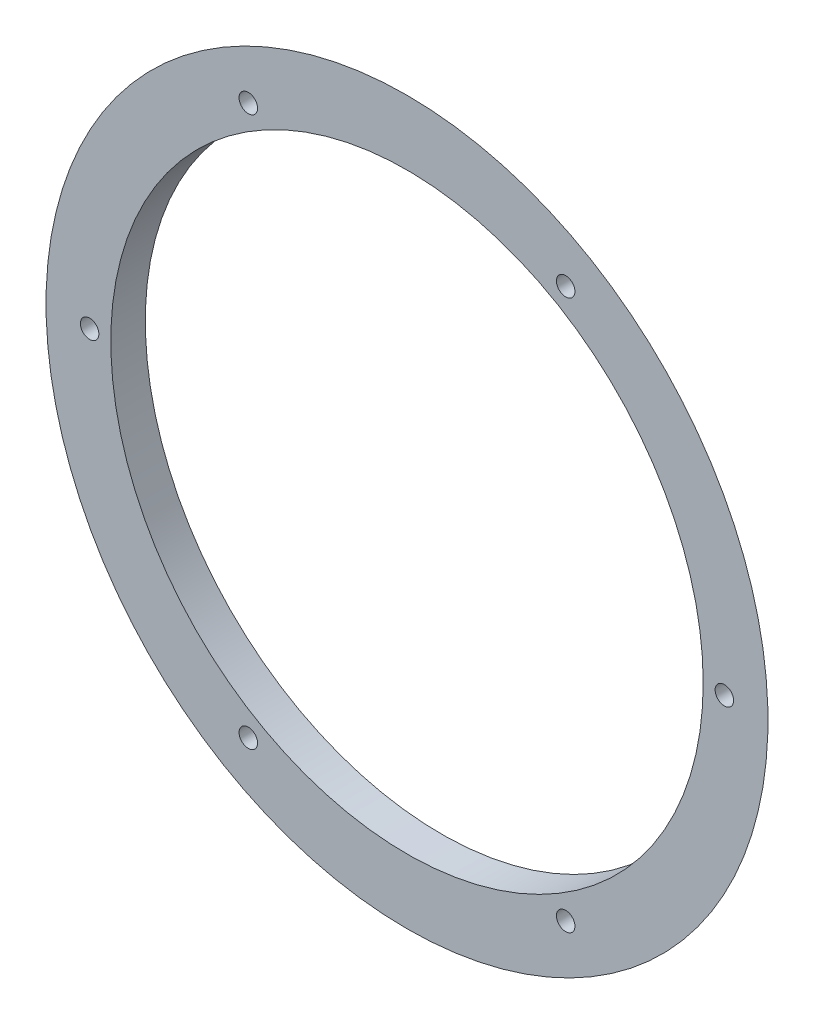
ISO-10303-21;
HEADER;
FILE_DESCRIPTION(('STEP AP214'),'2;1');
FILE_NAME('part.step','',(''),(''),'','','');
FILE_SCHEMA(('AUTOMOTIVE_DESIGN { 1 0 10303 214 1 1 1 1 }'));
ENDSEC;
DATA;
#1=APPLICATION_CONTEXT('core data for automotive mechanical design processes');
#2=APPLICATION_PROTOCOL_DEFINITION('international standard','automotive_design',2000,#1);
#3=PRODUCT_CONTEXT('',#1,'mechanical');
#4=PRODUCT('Part','Part','',(#3));
#5=PRODUCT_RELATED_PRODUCT_CATEGORY('part','',(#4));
#6=PRODUCT_DEFINITION_FORMATION('','',#4);
#7=PRODUCT_DEFINITION_CONTEXT('part definition',#1,'design');
#8=PRODUCT_DEFINITION('design','',#6,#7);
#9=PRODUCT_DEFINITION_SHAPE('','',#8);
#10=(LENGTH_UNIT() NAMED_UNIT(*) SI_UNIT(.MILLI.,.METRE.));
#11=(NAMED_UNIT(*) PLANE_ANGLE_UNIT() SI_UNIT($,.RADIAN.));
#12=(NAMED_UNIT(*) SI_UNIT($,.STERADIAN.) SOLID_ANGLE_UNIT());
#13=UNCERTAINTY_MEASURE_WITH_UNIT(LENGTH_MEASURE(1.E-05),#10,'distance_accuracy_value','');
#14=(GEOMETRIC_REPRESENTATION_CONTEXT(3) GLOBAL_UNCERTAINTY_ASSIGNED_CONTEXT((#13)) GLOBAL_UNIT_ASSIGNED_CONTEXT((#10,
#11,#12)) REPRESENTATION_CONTEXT('',''));
#15=CARTESIAN_POINT('',(0.,0.,0.));
#16=DIRECTION('',(0.,0.,1.));
#17=DIRECTION('',(1.,0.,0.));
#18=AXIS2_PLACEMENT_3D('',#15,#16,#17);
#19=CARTESIAN_POINT('',(0.,0.,-9.525));
#20=DIRECTION('',(0.,0.,1.));
#21=DIRECTION('',(1.,0.,0.));
#22=AXIS2_PLACEMENT_3D('',#19,#20,#21);
#23=PLANE('',#22);
#24=CARTESIAN_POINT('',(0.,0.,-9.525));
#25=DIRECTION('',(0.,0.,1.));
#26=DIRECTION('',(1.,0.,0.));
#27=AXIS2_PLACEMENT_3D('',#24,#25,#26);
#28=CIRCLE('',#27,81.788);
#29=CARTESIAN_POINT('',(81.788,0.,-9.525));
#30=VERTEX_POINT('',#29);
#31=EDGE_CURVE('E10',#30,#30,#28,.T.);
#32=ORIENTED_EDGE('',*,*,#31,.T.);
#33=EDGE_LOOP('',(#32));
#34=FACE_BOUND('',#33,.T.);
#35=CARTESIAN_POINT('',(0.,0.,-9.52500000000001));
#36=DIRECTION('',(0.,0.,-1.));
#37=DIRECTION('',(0.,1.,0.));
#38=AXIS2_PLACEMENT_3D('',#35,#36,#37);
#39=CIRCLE('',#38,83.068649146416);
#40=CARTESIAN_POINT('',(0.,83.068649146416,-9.52500000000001));
#41=VERTEX_POINT('',#40);
#42=EDGE_CURVE('E179',#41,#41,#39,.T.);
#43=ORIENTED_EDGE('',*,*,#42,.T.);
#44=EDGE_LOOP('',(#43));
#45=FACE_BOUND('',#44,.T.);
#46=ADVANCED_FACE('F49',(#34,#45),#23,.F.);
#47=CARTESIAN_POINT('',(0.,0.,0.));
#48=DIRECTION('',(0.,0.,1.));
#49=DIRECTION('',(1.,0.,0.));
#50=AXIS2_PLACEMENT_3D('',#47,#48,#49);
#51=PLANE('',#50);
#52=CARTESIAN_POINT('',(-87.63,0.,0.));
#53=DIRECTION('',(0.,0.,1.));
#54=DIRECTION('',(1.,0.,0.));
#55=AXIS2_PLACEMENT_3D('',#52,#53,#54);
#56=CIRCLE('',#55,2.55270000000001);
#57=CARTESIAN_POINT('',(-85.0773,0.,0.));
#58=VERTEX_POINT('',#57);
#59=EDGE_CURVE('E91',#58,#58,#56,.T.);
#60=ORIENTED_EDGE('',*,*,#59,.F.);
#61=EDGE_LOOP('',(#60));
#62=FACE_BOUND('',#61,.T.);
#63=CARTESIAN_POINT('',(-43.815,75.8898061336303,0.));
#64=DIRECTION('',(0.,0.,1.));
#65=DIRECTION('',(1.,0.,0.));
#66=AXIS2_PLACEMENT_3D('',#63,#64,#65);
#67=CIRCLE('',#66,2.5527);
#68=CARTESIAN_POINT('',(-41.2623,75.8898061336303,0.));
#69=VERTEX_POINT('',#68);
#70=EDGE_CURVE('E87',#69,#69,#67,.T.);
#71=ORIENTED_EDGE('',*,*,#70,.F.);
#72=EDGE_LOOP('',(#71));
#73=FACE_BOUND('',#72,.T.);
#74=CARTESIAN_POINT('',(43.815,75.8898061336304,0.));
#75=DIRECTION('',(0.,0.,1.));
#76=DIRECTION('',(1.,0.,0.));
#77=AXIS2_PLACEMENT_3D('',#74,#75,#76);
#78=CIRCLE('',#77,2.5527);
#79=CARTESIAN_POINT('',(46.3677,75.8898061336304,0.));
#80=VERTEX_POINT('',#79);
#81=EDGE_CURVE('E83',#80,#80,#78,.T.);
#82=ORIENTED_EDGE('',*,*,#81,.F.);
#83=EDGE_LOOP('',(#82));
#84=FACE_BOUND('',#83,.T.);
#85=CARTESIAN_POINT('',(87.63,0.,0.));
#86=DIRECTION('',(0.,0.,1.));
#87=DIRECTION('',(1.,0.,0.));
#88=AXIS2_PLACEMENT_3D('',#85,#86,#87);
#89=CIRCLE('',#88,2.55270000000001);
#90=CARTESIAN_POINT('',(90.1827,0.,0.));
#91=VERTEX_POINT('',#90);
#92=EDGE_CURVE('E79',#91,#91,#89,.T.);
#93=ORIENTED_EDGE('',*,*,#92,.F.);
#94=EDGE_LOOP('',(#93));
#95=FACE_BOUND('',#94,.T.);
#96=CARTESIAN_POINT('',(43.815,-75.8898061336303,0.));
#97=DIRECTION('',(0.,0.,1.));
#98=DIRECTION('',(1.,0.,0.));
#99=AXIS2_PLACEMENT_3D('',#96,#97,#98);
#100=CIRCLE('',#99,2.5527);
#101=CARTESIAN_POINT('',(46.3677,-75.8898061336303,0.));
#102=VERTEX_POINT('',#101);
#103=EDGE_CURVE('E75',#102,#102,#100,.T.);
#104=ORIENTED_EDGE('',*,*,#103,.F.);
#105=EDGE_LOOP('',(#104));
#106=FACE_BOUND('',#105,.T.);
#107=CARTESIAN_POINT('',(-43.815,-75.8898061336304,0.));
#108=DIRECTION('',(0.,0.,1.));
#109=DIRECTION('',(1.,0.,0.));
#110=AXIS2_PLACEMENT_3D('',#107,#108,#109);
#111=CIRCLE('',#110,2.5527);
#112=CARTESIAN_POINT('',(-41.2623,-75.8898061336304,0.));
#113=VERTEX_POINT('',#112);
#114=EDGE_CURVE('E70',#113,#113,#111,.T.);
#115=ORIENTED_EDGE('',*,*,#114,.F.);
#116=EDGE_LOOP('',(#115));
#117=FACE_BOUND('',#116,.T.);
#118=CARTESIAN_POINT('',(0.,0.,0.));
#119=DIRECTION('',(0.,0.,1.));
#120=DIRECTION('',(1.,0.,0.));
#121=AXIS2_PLACEMENT_3D('',#118,#119,#120);
#122=CIRCLE('',#121,81.788);
#123=CARTESIAN_POINT('',(81.788,0.,0.));
#124=VERTEX_POINT('',#123);
#125=EDGE_CURVE('E63',#124,#124,#122,.T.);
#126=ORIENTED_EDGE('',*,*,#125,.F.);
#127=EDGE_LOOP('',(#126));
#128=FACE_BOUND('',#127,.T.);
#129=CARTESIAN_POINT('',(0.,0.,0.));
#130=DIRECTION('',(0.,0.,-1.));
#131=DIRECTION('',(0.,1.,0.));
#132=AXIS2_PLACEMENT_3D('',#129,#130,#131);
#133=CIRCLE('',#132,99.6696);
#134=CARTESIAN_POINT('',(0.,99.6696,0.));
#135=VERTEX_POINT('',#134);
#136=EDGE_CURVE('E176',#135,#135,#133,.T.);
#137=ORIENTED_EDGE('',*,*,#136,.F.);
#138=EDGE_LOOP('',(#137));
#139=FACE_BOUND('',#138,.T.);
#140=ADVANCED_FACE('F51',(#62,#73,#84,#95,#106,#117,#128,#139),#51,.T.);
#141=CARTESIAN_POINT('',(0.,0.,-9.525));
#142=DIRECTION('',(0.,0.,1.));
#143=DIRECTION('',(1.,0.,0.));
#144=AXIS2_PLACEMENT_3D('',#141,#142,#143);
#145=CYLINDRICAL_SURFACE('',#144,81.788);
#146=ORIENTED_EDGE('',*,*,#31,.F.);
#147=EDGE_LOOP('',(#146));
#148=FACE_BOUND('',#147,.T.);
#149=ORIENTED_EDGE('',*,*,#125,.T.);
#150=EDGE_LOOP('',(#149));
#151=FACE_BOUND('',#150,.T.);
#152=ADVANCED_FACE('F156',(#148,#151),#145,.F.);
#153=CARTESIAN_POINT('',(-43.815,-75.8898061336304,0.));
#154=DIRECTION('',(0.,0.,1.));
#155=DIRECTION('',(1.,0.,0.));
#156=AXIS2_PLACEMENT_3D('',#153,#154,#155);
#157=CYLINDRICAL_SURFACE('',#156,2.5527);
#158=CARTESIAN_POINT('',(-45.6364177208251,-77.6783012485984,-5.77436857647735));
#159=CARTESIAN_POINT('',(-45.7338059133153,-77.5791080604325,-5.79471515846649));
#160=CARTESIAN_POINT('',(-45.8225791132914,-77.4724106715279,-5.82096701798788));
#161=CARTESIAN_POINT('',(-45.9807200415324,-77.2480660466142,-5.88393819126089));
#162=CARTESIAN_POINT('',(-46.0500385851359,-77.1303920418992,-5.92068357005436));
#163=CARTESIAN_POINT('',(-46.167941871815,-76.8887614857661,-6.0027762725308));
#164=CARTESIAN_POINT('',(-46.2166325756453,-76.7648407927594,-6.04807786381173));
#165=CARTESIAN_POINT('',(-46.2937786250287,-76.5136696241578,-6.1457312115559));
#166=CARTESIAN_POINT('',(-46.322240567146,-76.3864202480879,-6.19808066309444));
#167=CARTESIAN_POINT('',(-46.3611133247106,-76.1204109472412,-6.3130775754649));
#168=CARTESIAN_POINT('',(-46.3697465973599,-75.9816089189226,-6.37622429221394));
#169=CARTESIAN_POINT('',(-46.3648359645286,-75.7066466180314,-6.50722957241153));
#170=CARTESIAN_POINT('',(-46.3512799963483,-75.5704878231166,-6.57509067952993));
#171=CARTESIAN_POINT('',(-46.3003010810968,-75.2876632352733,-6.72216128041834));
#172=CARTESIAN_POINT('',(-46.2602306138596,-75.1416745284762,-6.8017604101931));
#173=CARTESIAN_POINT('',(-46.15552089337,-74.8598230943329,-6.9627461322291));
#174=CARTESIAN_POINT('',(-46.0908705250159,-74.7239649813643,-7.04413351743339));
#175=CARTESIAN_POINT('',(-45.932987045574,-74.4557913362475,-7.21287026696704));
#176=CARTESIAN_POINT('',(-45.8379672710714,-74.3245141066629,-7.30020677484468));
#177=CARTESIAN_POINT('',(-45.6237734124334,-74.0812468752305,-7.47223697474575));
#178=CARTESIAN_POINT('',(-45.5045940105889,-73.9692611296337,-7.55693008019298));
#179=CARTESIAN_POINT('',(-45.2450566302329,-73.7689541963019,-7.72083670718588));
#180=CARTESIAN_POINT('',(-45.1047539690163,-73.680572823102,-7.80006377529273));
#181=CARTESIAN_POINT('',(-44.8061237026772,-73.531468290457,-7.95034864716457));
#182=CARTESIAN_POINT('',(-44.6478044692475,-73.4707323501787,-8.0214102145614));
#183=CARTESIAN_POINT('',(-44.3321895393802,-73.3851776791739,-8.14641131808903));
#184=CARTESIAN_POINT('',(-44.1759980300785,-73.3576987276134,-8.20130169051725));
#185=CARTESIAN_POINT('',(-43.8574870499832,-73.3324824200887,-8.29881855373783));
#186=CARTESIAN_POINT('',(-43.6951747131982,-73.3347114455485,-8.34145885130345));
#187=CARTESIAN_POINT('',(-43.3919443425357,-73.368402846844,-8.40733890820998));
#188=CARTESIAN_POINT('',(-43.2509890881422,-73.3960258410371,-8.43238050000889));
#189=CARTESIAN_POINT('',(-42.974251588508,-73.4752506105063,-8.46989814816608));
#190=CARTESIAN_POINT('',(-42.8384653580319,-73.526833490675,-8.48238408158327));
#191=CARTESIAN_POINT('',(-42.5905684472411,-73.646145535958,-8.49347210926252));
#192=CARTESIAN_POINT('',(-42.4774559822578,-73.7116884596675,-8.49336157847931));
#193=CARTESIAN_POINT('',(-42.2629262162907,-73.8589787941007,-8.4824503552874));
#194=CARTESIAN_POINT('',(-42.1615065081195,-73.9407228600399,-8.47165186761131));
#195=CARTESIAN_POINT('',(-41.9754688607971,-74.1154638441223,-8.44029148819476));
#196=CARTESIAN_POINT('',(-41.8904933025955,-74.2081270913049,-8.41998127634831));
#197=CARTESIAN_POINT('',(-41.7359662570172,-74.4033985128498,-8.37056703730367));
#198=CARTESIAN_POINT('',(-41.6664172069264,-74.5060082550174,-8.34146162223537));
#199=CARTESIAN_POINT('',(-41.5404643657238,-74.7238639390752,-8.27380207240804));
#200=CARTESIAN_POINT('',(-41.4849470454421,-74.8394908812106,-8.23483065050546));
#201=CARTESIAN_POINT('',(-41.3923866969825,-75.0753767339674,-8.1497175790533));
#202=CARTESIAN_POINT('',(-41.3553505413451,-75.1956373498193,-8.10357327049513));
#203=CARTESIAN_POINT('',(-41.2966251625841,-75.4505952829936,-8.00036231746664));
#204=CARTESIAN_POINT('',(-41.2769324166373,-75.58549336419,-7.94265885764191));
#205=CARTESIAN_POINT('',(-41.2589907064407,-75.8542807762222,-7.82186891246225));
#206=CARTESIAN_POINT('',(-41.2607517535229,-75.9881696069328,-7.75877992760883));
#207=CARTESIAN_POINT('',(-41.2861068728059,-76.2679187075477,-7.62102261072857));
#208=CARTESIAN_POINT('',(-41.3122729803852,-76.4133086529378,-7.54586955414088));
#209=CARTESIAN_POINT('',(-41.3885520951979,-76.6960944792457,-7.39272133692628));
#210=CARTESIAN_POINT('',(-41.4386762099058,-76.8334866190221,-7.31472487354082));
#211=CARTESIAN_POINT('',(-41.5668933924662,-77.1094400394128,-7.15049031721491));
#212=CARTESIAN_POINT('',(-41.6471319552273,-77.2469503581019,-7.06415305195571));
#213=CARTESIAN_POINT('',(-41.8320957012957,-77.5052362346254,-6.89256136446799));
#214=CARTESIAN_POINT('',(-41.9368291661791,-77.6260061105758,-6.80730731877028));
#215=CARTESIAN_POINT('',(-42.1712815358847,-77.8497419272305,-6.6382586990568));
#216=CARTESIAN_POINT('',(-42.3015443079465,-77.9522056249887,-6.5545495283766));
#217=CARTESIAN_POINT('',(-42.5823604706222,-78.1313664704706,-6.39363442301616));
#218=CARTESIAN_POINT('',(-42.7329100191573,-78.208068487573,-6.31642726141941));
#219=CARTESIAN_POINT('',(-43.0402591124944,-78.3273197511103,-6.1763361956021));
#220=CARTESIAN_POINT('',(-43.1960601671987,-78.3717231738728,-6.11285505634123));
#221=CARTESIAN_POINT('',(-43.517323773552,-78.4303311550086,-5.99746879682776));
#222=CARTESIAN_POINT('',(-43.6827753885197,-78.4445692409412,-5.94555088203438));
#223=CARTESIAN_POINT('',(-43.9961495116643,-78.4402533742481,-5.86198309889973));
#224=CARTESIAN_POINT('',(-44.1436458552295,-78.4256149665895,-5.82860130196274));
#225=CARTESIAN_POINT('',(-44.3628259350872,-78.3841441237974,-5.788321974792));
#226=CARTESIAN_POINT('',(-44.4355651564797,-78.3670595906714,-5.77652552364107));
#227=CARTESIAN_POINT('',(-44.5796957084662,-78.3264270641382,-5.75636018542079));
#228=CARTESIAN_POINT('',(-44.6510872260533,-78.3028799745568,-5.74799081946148));
#229=CARTESIAN_POINT('',(-44.8452725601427,-78.2291047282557,-5.72983235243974));
#230=CARTESIAN_POINT('',(-44.9659620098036,-78.1721893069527,-5.72378540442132));
#231=CARTESIAN_POINT('',(-45.1967701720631,-78.0402975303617,-5.72313862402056));
#232=CARTESIAN_POINT('',(-45.3069100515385,-77.9653584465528,-5.72851534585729));
#233=CARTESIAN_POINT('',(-45.4499752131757,-77.8508655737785,-5.74362204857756));
#234=CARTESIAN_POINT('',(-45.4887994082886,-77.817825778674,-5.74865428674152));
#235=CARTESIAN_POINT('',(-45.5642696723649,-77.7496232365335,-5.76031914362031));
#236=CARTESIAN_POINT('',(-45.6009161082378,-77.7144608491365,-5.76695149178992));
#237=CARTESIAN_POINT('',(-45.6364177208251,-77.6783012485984,-5.77436857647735));
#238=B_SPLINE_CURVE_WITH_KNOTS('',3,(#158,#159,#160,#161,#162,#163,#164,#165,#166,#167,#168,
#169,#170,#171,#172,#173,#174,#175,#176,#177,#178,#179,#180,#181,#182,#183,#184,#185,#186,#187,
#188,#189,#190,#191,#192,#193,#194,#195,#196,#197,#198,#199,#200,#201,#202,#203,#204,#205,#206,
#207,#208,#209,#210,#211,#212,#213,#214,#215,#216,#217,#218,#219,#220,#221,#222,#223,#224,#225,
#226,#227,#228,#229,#230,#231,#232,#233,#234,#235,#236,#237),.UNSPECIFIED.,.T.,.F.,(4,2,2,2,2,2,
2,2,2,2,2,2,2,2,2,2,2,2,2,2,2,2,2,2,2,2,2,2,2,2,2,2,2,2,2,2,2,2,2,4),(0.,0.421261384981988,
0.843578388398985,1.26369893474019,1.68368241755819,2.14005224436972,2.59667024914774,
3.10761065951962,3.61878239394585,4.16847130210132,4.71828133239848,5.26667579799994,
5.81481647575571,6.31537408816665,6.81536530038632,7.25033458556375,7.68496142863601,
8.07521312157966,8.46538432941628,8.8457692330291,9.22621419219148,9.62671896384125,
10.0273725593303,10.4696908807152,10.9122156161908,11.4073768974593,11.9027679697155,
12.4436452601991,12.9847056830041,13.5388748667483,14.0929392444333,14.6119394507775,
15.1303625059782,15.5832904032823,15.8099014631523,16.0364808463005,16.4349998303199,
16.8327016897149,16.9862930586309,17.1398584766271),.UNSPECIFIED.);
#239=CARTESIAN_POINT('',(-45.6364177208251,-77.6783012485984,-5.77436857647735));
#240=VERTEX_POINT('',#239);
#241=EDGE_CURVE('E95',#240,#240,#238,.T.);
#242=ORIENTED_EDGE('',*,*,#241,.T.);
#243=EDGE_LOOP('',(#242));
#244=FACE_BOUND('',#243,.T.);
#245=ORIENTED_EDGE('',*,*,#114,.T.);
#246=EDGE_LOOP('',(#245));
#247=FACE_BOUND('',#246,.T.);
#248=ADVANCED_FACE('F109',(#244,#247),#157,.F.);
#249=CARTESIAN_POINT('',(43.815,-75.8898061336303,0.));
#250=DIRECTION('',(0.,0.,1.));
#251=DIRECTION('',(1.,0.,0.));
#252=AXIS2_PLACEMENT_3D('',#249,#250,#251);
#253=CYLINDRICAL_SURFACE('',#252,2.5527);
#254=CARTESIAN_POINT('',(41.6071194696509,-77.1710324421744,-7.11063967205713));
#255=CARTESIAN_POINT('',(41.5272075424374,-77.033315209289,-7.19698372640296));
#256=CARTESIAN_POINT('',(41.4601076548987,-76.8879742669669,-7.28336451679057));
#257=CARTESIAN_POINT('',(41.3538025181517,-76.5858599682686,-7.45379945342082));
#258=CARTESIAN_POINT('',(41.3146429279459,-76.4290683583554,-7.53784957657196));
#259=CARTESIAN_POINT('',(41.2664440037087,-76.1078985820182,-7.70123593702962));
#260=CARTESIAN_POINT('',(41.2574859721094,-75.9435011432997,-7.78055888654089));
#261=CARTESIAN_POINT('',(41.2720122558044,-75.6125247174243,-7.93136218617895));
#262=CARTESIAN_POINT('',(41.2954745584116,-75.4459472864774,-8.00284782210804));
#263=CARTESIAN_POINT('',(41.3732127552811,-75.1292342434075,-8.12975622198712));
#264=CARTESIAN_POINT('',(41.4249899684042,-74.9788167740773,-8.18599005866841));
#265=CARTESIAN_POINT('',(41.5577312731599,-74.6870524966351,-8.28632165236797));
#266=CARTESIAN_POINT('',(41.6386646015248,-74.5456963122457,-8.33043211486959));
#267=CARTESIAN_POINT('',(41.8160081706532,-74.2958568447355,-8.39914535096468));
#268=CARTESIAN_POINT('',(41.9090703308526,-74.1854857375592,-8.42553163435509));
#269=CARTESIAN_POINT('',(42.1139057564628,-73.9810270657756,-8.46568093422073));
#270=CARTESIAN_POINT('',(42.2256635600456,-73.8869261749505,-8.4794543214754));
#271=CARTESIAN_POINT('',(42.4516240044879,-73.7277340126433,-8.49283473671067));
#272=CARTESIAN_POINT('',(42.5643415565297,-73.6606355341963,-8.49377574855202));
#273=CARTESIAN_POINT('',(42.7983669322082,-73.5446463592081,-8.48486979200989));
#274=CARTESIAN_POINT('',(42.9196727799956,-73.4957514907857,-8.47502529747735));
#275=CARTESIAN_POINT('',(43.1635100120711,-73.4184235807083,-8.44547306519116));
#276=CARTESIAN_POINT('',(43.2859032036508,-73.3894369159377,-8.42606044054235));
#277=CARTESIAN_POINT('',(43.5318947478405,-73.3497947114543,-8.37836010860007));
#278=CARTESIAN_POINT('',(43.6554932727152,-73.3391418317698,-8.35007111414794));
#279=CARTESIAN_POINT('',(43.9069427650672,-73.3355138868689,-8.28408907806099));
#280=CARTESIAN_POINT('',(44.0347011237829,-73.3434405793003,-8.24599963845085));
#281=CARTESIAN_POINT('',(44.2852790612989,-73.3776109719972,-8.16257425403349));
#282=CARTESIAN_POINT('',(44.4080968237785,-73.4038613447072,-8.11723567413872));
#283=CARTESIAN_POINT('',(44.6586511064,-73.4766668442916,-8.01570980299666));
#284=CARTESIAN_POINT('',(44.7856048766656,-73.5250248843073,-7.95888712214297));
#285=CARTESIAN_POINT('',(45.0282366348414,-73.6398343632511,-7.83976231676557));
#286=CARTESIAN_POINT('',(45.1439093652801,-73.7062941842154,-7.77745766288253));
#287=CARTESIAN_POINT('',(45.375122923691,-73.8639419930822,-7.64123693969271));
#288=CARTESIAN_POINT('',(45.4890057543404,-73.9571328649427,-7.5668219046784));
#289=CARTESIAN_POINT('',(45.698241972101,-74.1603628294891,-7.41500275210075));
#290=CARTESIAN_POINT('',(45.7935866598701,-74.2704097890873,-7.33759725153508));
#291=CARTESIAN_POINT('',(45.9720181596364,-74.5155315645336,-7.1742499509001));
#292=CARTESIAN_POINT('',(46.053107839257,-74.6519869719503,-7.08819017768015));
#293=CARTESIAN_POINT('',(46.1889066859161,-74.9380063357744,-6.91693055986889));
#294=CARTESIAN_POINT('',(46.2436067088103,-75.0875748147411,-6.83173102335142));
#295=CARTESIAN_POINT('',(46.3256930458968,-75.4003537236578,-6.6622021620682));
#296=CARTESIAN_POINT('',(46.352267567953,-75.5638295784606,-6.57796476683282));
#297=CARTESIAN_POINT('',(46.3731050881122,-75.8959598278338,-6.41571910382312));
#298=CARTESIAN_POINT('',(46.3673729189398,-76.0646134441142,-6.33770990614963));
#299=CARTESIAN_POINT('',(46.3230192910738,-76.3914904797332,-6.19547897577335));
#300=CARTESIAN_POINT('',(46.2863684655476,-76.5497393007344,-6.13071394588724));
#301=CARTESIAN_POINT('',(46.1817682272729,-76.8600700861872,-6.01257430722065));
#302=CARTESIAN_POINT('',(46.1138510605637,-77.0121582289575,-5.95918804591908));
#303=CARTESIAN_POINT('',(45.9575994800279,-77.2852023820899,-5.87268291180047));
#304=CARTESIAN_POINT('',(45.8728615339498,-77.4076766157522,-5.83786791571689));
#305=CARTESIAN_POINT('',(45.6814871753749,-77.6376050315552,-5.78132045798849));
#306=CARTESIAN_POINT('',(45.5748733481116,-77.745074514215,-5.7595745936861));
#307=CARTESIAN_POINT('',(45.3573418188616,-77.928227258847,-5.73231169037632));
#308=CARTESIAN_POINT('',(45.2485416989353,-78.0061898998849,-5.72513635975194));
#309=CARTESIAN_POINT('',(45.0199792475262,-78.1441564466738,-5.72229136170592));
#310=CARTESIAN_POINT('',(44.9002210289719,-78.2041670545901,-5.72661739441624));
#311=CARTESIAN_POINT('',(44.6602772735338,-78.3017899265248,-5.74599422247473));
#312=CARTESIAN_POINT('',(44.5404594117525,-78.3404311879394,-5.76045714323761));
#313=CARTESIAN_POINT('',(44.297905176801,-78.3995201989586,-5.79878955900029));
#314=CARTESIAN_POINT('',(44.1751685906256,-78.4199666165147,-5.82265974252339));
#315=CARTESIAN_POINT('',(43.926081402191,-78.4432514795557,-5.8797073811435));
#316=CARTESIAN_POINT('',(43.7997400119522,-78.445509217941,-5.91315670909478));
#317=CARTESIAN_POINT('',(43.550386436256,-78.4318260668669,-5.987728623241));
#318=CARTESIAN_POINT('',(43.427375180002,-78.4158801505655,-6.02885332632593));
#319=CARTESIAN_POINT('',(43.1757792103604,-78.3648151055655,-6.1216493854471));
#320=CARTESIAN_POINT('',(43.0477676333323,-78.3280253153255,-6.17395035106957));
#321=CARTESIAN_POINT('',(42.8011720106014,-78.2362429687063,-6.28452017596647));
#322=CARTESIAN_POINT('',(42.6825949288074,-78.181237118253,-6.34279337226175));
#323=CARTESIAN_POINT('',(42.4430987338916,-78.0473982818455,-6.47114806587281));
#324=CARTESIAN_POINT('',(42.3236545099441,-77.9664787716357,-6.54180322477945));
#325=CARTESIAN_POINT('',(42.1013755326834,-77.7872090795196,-6.68670868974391));
#326=CARTESIAN_POINT('',(41.9985280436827,-77.6888723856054,-6.76095618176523));
#327=CARTESIAN_POINT('',(41.8483637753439,-77.5194915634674,-6.88142378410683));
#328=CARTESIAN_POINT('',(41.7952123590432,-77.4531136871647,-6.92706707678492));
#329=CARTESIAN_POINT('',(41.6958690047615,-77.3155555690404,-7.01868332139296));
#330=CARTESIAN_POINT('',(41.6496773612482,-77.2443751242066,-7.06465628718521));
#331=CARTESIAN_POINT('',(41.6071194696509,-77.1710324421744,-7.11063967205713));
#332=B_SPLINE_CURVE_WITH_KNOTS('',3,(#254,#255,#256,#257,#258,#259,#260,#261,#262,#263,#264,
#265,#266,#267,#268,#269,#270,#271,#272,#273,#274,#275,#276,#277,#278,#279,#280,#281,#282,#283,
#284,#285,#286,#287,#288,#289,#290,#291,#292,#293,#294,#295,#296,#297,#298,#299,#300,#301,#302,
#303,#304,#305,#306,#307,#308,#309,#310,#311,#312,#313,#314,#315,#316,#317,#318,#319,#320,#321,
#322,#323,#324,#325,#326,#327,#328,#329,#330,#331),.UNSPECIFIED.,.T.,.F.,(4,2,2,2,2,2,2,2,2,2,2,
2,2,2,2,2,2,2,2,2,2,2,2,2,2,2,2,2,2,2,2,2,2,2,2,2,2,2,4),(0.,0.543043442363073,1.08697228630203,
1.63236421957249,2.17738602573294,2.68064817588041,3.18338087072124,3.62119542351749,
4.05864966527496,4.45023453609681,4.8417296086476,5.22184131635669,5.60200816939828,
6.00100553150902,6.40014826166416,6.84013544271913,7.28032670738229,7.77296846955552,
8.26584085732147,8.80508286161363,9.34451158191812,9.89911751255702,10.453640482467,
10.9752779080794,11.4963785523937,11.9525772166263,12.4083072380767,12.8083530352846,
13.2082492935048,13.5866897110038,13.9651578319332,14.3556631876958,14.7462764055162,
15.1738314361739,15.6016991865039,16.0816978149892,16.5613263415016,16.8505172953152,
17.1397204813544),.UNSPECIFIED.);
#333=CARTESIAN_POINT('',(41.6071194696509,-77.1710324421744,-7.11063967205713));
#334=VERTEX_POINT('',#333);
#335=EDGE_CURVE('E103',#334,#334,#332,.T.);
#336=ORIENTED_EDGE('',*,*,#335,.T.);
#337=EDGE_LOOP('',(#336));
#338=FACE_BOUND('',#337,.T.);
#339=ORIENTED_EDGE('',*,*,#103,.T.);
#340=EDGE_LOOP('',(#339));
#341=FACE_BOUND('',#340,.T.);
#342=ADVANCED_FACE('F147',(#338,#341),#253,.F.);
#343=CARTESIAN_POINT('',(87.63,0.,0.));
#344=DIRECTION('',(0.,0.,1.));
#345=DIRECTION('',(1.,0.,0.));
#346=AXIS2_PLACEMENT_3D('',#343,#344,#345);
#347=CYLINDRICAL_SURFACE('',#346,2.55270000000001);
#348=CARTESIAN_POINT('',(85.7704955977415,-1.7488633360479,-8.11893176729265));
#349=CARTESIAN_POINT('',(85.6806787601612,-1.65336273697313,-8.16733614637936));
#350=CARTESIAN_POINT('',(85.5973190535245,-1.54996242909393,-8.21223927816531));
#351=CARTESIAN_POINT('',(85.4464797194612,-1.32905760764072,-8.29346350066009));
#352=CARTESIAN_POINT('',(85.3790013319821,-1.21155199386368,-8.32978392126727));
#353=CARTESIAN_POINT('',(85.2625858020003,-0.964538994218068,-8.39242962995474));
#354=CARTESIAN_POINT('',(85.2137253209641,-0.834984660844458,-8.41871359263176));
#355=CARTESIAN_POINT('',(85.1374235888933,-0.567972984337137,-8.45975358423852));
#356=CARTESIAN_POINT('',(85.1099733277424,-0.430518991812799,-8.47451446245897));
#357=CARTESIAN_POINT('',(85.0790386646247,-0.161318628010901,-8.49114860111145));
#358=CARTESIAN_POINT('',(85.0741068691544,-0.0297853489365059,-8.49380019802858));
#359=CARTESIAN_POINT('',(85.0845082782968,0.232224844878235,-8.48820743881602));
#360=CARTESIAN_POINT('',(85.0998375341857,0.362701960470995,-8.47996520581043));
#361=CARTESIAN_POINT('',(85.149139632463,0.61442511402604,-8.45345180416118));
#362=CARTESIAN_POINT('',(85.1824749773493,0.735833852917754,-8.43552356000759));
#363=CARTESIAN_POINT('',(85.2658784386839,0.970966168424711,-8.39065665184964));
#364=CARTESIAN_POINT('',(85.3159485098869,1.08468884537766,-8.36371693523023));
#365=CARTESIAN_POINT('',(85.4334096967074,1.30680637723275,-8.3004975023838));
#366=CARTESIAN_POINT('',(85.5014679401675,1.41474433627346,-8.26385793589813));
#367=CARTESIAN_POINT('',(85.6512155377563,1.61759142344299,-8.18320736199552));
#368=CARTESIAN_POINT('',(85.7329096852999,1.71249594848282,-8.13919376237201));
#369=CARTESIAN_POINT('',(85.9161186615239,1.89667892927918,-8.04044190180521));
#370=CARTESIAN_POINT('',(86.0187965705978,1.98445996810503,-7.98507243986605));
#371=CARTESIAN_POINT('',(86.2344789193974,2.14164193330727,-7.86869880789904));
#372=CARTESIAN_POINT('',(86.3474880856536,2.21103438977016,-7.80769205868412));
#373=CARTESIAN_POINT('',(86.5949287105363,2.33804906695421,-7.67403283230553));
#374=CARTESIAN_POINT('',(86.7303074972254,2.39327972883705,-7.60085927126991));
#375=CARTESIAN_POINT('',(87.0068326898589,2.4797077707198,-7.45128815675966));
#376=CARTESIAN_POINT('',(87.1479817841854,2.51089381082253,-7.37488909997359));
#377=CARTESIAN_POINT('',(87.4466683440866,2.55098462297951,-7.21310286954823));
#378=CARTESIAN_POINT('',(87.6044608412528,2.55741787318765,-7.12756617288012));
#379=CARTESIAN_POINT('',(87.9188715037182,2.54118637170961,-6.95699361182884));
#380=CARTESIAN_POINT('',(88.0754892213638,2.51851104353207,-6.87195794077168));
#381=CARTESIAN_POINT('',(88.3886263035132,2.44286418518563,-6.70180870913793));
#382=CARTESIAN_POINT('',(88.544956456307,2.38887599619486,-6.61679335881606));
#383=CARTESIAN_POINT('',(88.8467639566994,2.2501839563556,-6.452541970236));
#384=CARTESIAN_POINT('',(88.9922422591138,2.16548281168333,-6.37330542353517));
#385=CARTESIAN_POINT('',(89.2593980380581,1.97157868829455,-6.22769892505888));
#386=CARTESIAN_POINT('',(89.3819250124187,1.86389916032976,-6.1608713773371));
#387=CARTESIAN_POINT('',(89.6065384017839,1.62374614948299,-6.03829982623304));
#388=CARTESIAN_POINT('',(89.7086446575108,1.49129697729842,-5.98254506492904));
#389=CARTESIAN_POINT('',(89.8758412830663,1.22243867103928,-5.89121172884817));
#390=CARTESIAN_POINT('',(89.943921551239,1.08846528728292,-5.85400492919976));
#391=CARTESIAN_POINT('',(90.0280163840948,0.878357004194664,-5.80803526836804));
#392=CARTESIAN_POINT('',(90.0530455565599,0.806787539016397,-5.79435114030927));
#393=CARTESIAN_POINT('',(90.0967580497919,0.661180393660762,-5.77045000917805));
#394=CARTESIAN_POINT('',(90.1154421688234,0.587143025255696,-5.76023256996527));
#395=CARTESIAN_POINT('',(90.1576149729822,0.381154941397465,-5.73716898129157));
#396=CARTESIAN_POINT('',(90.1742528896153,0.247288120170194,-5.72806819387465));
#397=CARTESIAN_POINT('',(90.1861552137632,-0.0215751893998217,-5.72155789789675));
#398=CARTESIAN_POINT('',(90.1814285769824,-0.156571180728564,-5.72414349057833));
#399=CARTESIAN_POINT('',(90.1518429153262,-0.415346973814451,-5.74032535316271));
#400=CARTESIAN_POINT('',(90.1282152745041,-0.539312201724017,-5.75324816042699));
#401=CARTESIAN_POINT('',(90.0634724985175,-0.781128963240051,-5.7886507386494));
#402=CARTESIAN_POINT('',(90.0223566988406,-0.898980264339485,-5.81113087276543));
#403=CARTESIAN_POINT('',(89.923109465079,-1.12870960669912,-5.86537847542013));
#404=CARTESIAN_POINT('',(89.8645687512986,-1.24035699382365,-5.89736930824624));
#405=CARTESIAN_POINT('',(89.7331601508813,-1.45208003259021,-5.96915334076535));
#406=CARTESIAN_POINT('',(89.6602877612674,-1.55215203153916,-6.00894899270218));
#407=CARTESIAN_POINT('',(89.4953892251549,-1.74768633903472,-6.09896079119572));
#408=CARTESIAN_POINT('',(89.4022235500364,-1.84190049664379,-6.14979565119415));
#409=CARTESIAN_POINT('',(89.2046081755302,-2.01346285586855,-6.25756455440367));
#410=CARTESIAN_POINT('',(89.1001533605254,-2.0908033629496,-6.31450136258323));
#411=CARTESIAN_POINT('',(88.8695459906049,-2.23619068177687,-6.44012930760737));
#412=CARTESIAN_POINT('',(88.742296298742,-2.30198876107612,-6.50940969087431));
#413=CARTESIAN_POINT('',(88.4805178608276,-2.41102192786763,-6.65183563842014));
#414=CARTESIAN_POINT('',(88.3459859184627,-2.45424701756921,-6.72498289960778));
#415=CARTESIAN_POINT('',(88.0580079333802,-2.5213548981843,-6.88145076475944));
#416=CARTESIAN_POINT('',(87.9040877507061,-2.54264623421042,-6.96501723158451));
#417=CARTESIAN_POINT('',(87.5951025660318,-2.55714760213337,-7.13263970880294));
#418=CARTESIAN_POINT('',(87.440036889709,-2.55033951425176,-7.21669600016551));
#419=CARTESIAN_POINT('',(87.1246832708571,-2.50750207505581,-7.38750771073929));
#420=CARTESIAN_POINT('',(86.9645492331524,-2.46995563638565,-7.47417278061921));
#421=CARTESIAN_POINT('',(86.6524443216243,-2.36384608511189,-7.64295487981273));
#422=CARTESIAN_POINT('',(86.5004646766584,-2.29531707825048,-7.72507679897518));
#423=CARTESIAN_POINT('',(86.2489803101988,-2.15038001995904,-7.86087125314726));
#424=CARTESIAN_POINT('',(86.1463214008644,-2.08099526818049,-7.91627349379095));
#425=CARTESIAN_POINT('',(85.9505895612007,-1.92649483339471,-8.02185491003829));
#426=CARTESIAN_POINT('',(85.8575121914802,-1.84138648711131,-8.07203650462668));
#427=CARTESIAN_POINT('',(85.7704955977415,-1.7488633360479,-8.11893176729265));
#428=B_SPLINE_CURVE_WITH_KNOTS('',3,(#348,#349,#350,#351,#352,#353,#354,#355,#356,#357,#358,
#359,#360,#361,#362,#363,#364,#365,#366,#367,#368,#369,#370,#371,#372,#373,#374,#375,#376,#377,
#378,#379,#380,#381,#382,#383,#384,#385,#386,#387,#388,#389,#390,#391,#392,#393,#394,#395,#396,
#397,#398,#399,#400,#401,#402,#403,#404,#405,#406,#407,#408,#409,#410,#411,#412,#413,#414,#415,
#416,#417,#418,#419,#420,#421,#422,#423,#424,#425,#426,#427),.UNSPECIFIED.,.T.,.F.,(4,2,2,2,2,2,
2,2,2,2,2,2,2,2,2,2,2,2,2,2,2,2,2,2,2,2,2,2,2,2,2,2,2,2,2,2,2,2,2,4),(0.,0.418843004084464,
0.83771869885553,1.25830099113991,1.6787061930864,2.0716697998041,2.46455683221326,
2.84436736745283,3.22422228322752,3.62084783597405,4.01761310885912,4.45382486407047,
4.89023719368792,5.37870954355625,5.86741212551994,6.4038086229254,6.94040007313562,
7.49547459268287,8.05050021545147,8.57632639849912,9.10163918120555,9.56313565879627,
9.79393645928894,10.0247082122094,10.4280049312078,10.8311326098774,11.2099475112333,
11.5887768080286,11.9773200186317,12.3659855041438,12.7900190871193,13.214245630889,
13.6896800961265,14.1653249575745,14.6923114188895,15.2196377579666,15.7746808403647,
16.3291144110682,16.735087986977,17.1408726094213),.UNSPECIFIED.);
#429=CARTESIAN_POINT('',(85.7704955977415,-1.7488633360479,-8.11893176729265));
#430=VERTEX_POINT('',#429);
#431=EDGE_CURVE('E136',#430,#430,#428,.T.);
#432=ORIENTED_EDGE('',*,*,#431,.T.);
#433=EDGE_LOOP('',(#432));
#434=FACE_BOUND('',#433,.T.);
#435=ORIENTED_EDGE('',*,*,#92,.T.);
#436=EDGE_LOOP('',(#435));
#437=FACE_BOUND('',#436,.T.);
#438=ADVANCED_FACE('F143',(#434,#437),#347,.F.);
#439=CARTESIAN_POINT('',(43.815,75.8898061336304,0.));
#440=DIRECTION('',(0.,0.,1.));
#441=DIRECTION('',(1.,0.,0.));
#442=AXIS2_PLACEMENT_3D('',#439,#440,#441);
#443=CYLINDRICAL_SURFACE('',#442,2.5527);
#444=CARTESIAN_POINT('',(42.3945835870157,73.7687935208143,-8.48905014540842));
#445=CARTESIAN_POINT('',(42.2844160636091,73.8425835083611,-8.48430754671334));
#446=CARTESIAN_POINT('',(42.1800608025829,73.9249651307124,-8.47400153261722));
#447=CARTESIAN_POINT('',(41.986114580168,74.1040434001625,-8.44274817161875));
#448=CARTESIAN_POINT('',(41.8965509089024,74.2007658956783,-8.42178144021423));
#449=CARTESIAN_POINT('',(41.7346448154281,74.4047837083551,-8.3702772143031));
#450=CARTESIAN_POINT('',(41.6622407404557,74.5120391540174,-8.33977492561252));
#451=CARTESIAN_POINT('',(41.5353284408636,74.7340644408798,-8.27042839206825));
#452=CARTESIAN_POINT('',(41.4808173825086,74.84883308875,-8.23158546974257));
#453=CARTESIAN_POINT('',(41.3873626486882,75.0895212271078,-8.14447132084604));
#454=CARTESIAN_POINT('',(41.3494843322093,75.2157033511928,-8.09578867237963));
#455=CARTESIAN_POINT('',(41.2937144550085,75.4698692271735,-7.99214415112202));
#456=CARTESIAN_POINT('',(41.2758314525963,75.597853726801,-7.93717960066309));
#457=CARTESIAN_POINT('',(41.258399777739,75.8679499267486,-7.8156383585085));
#458=CARTESIAN_POINT('',(41.2612654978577,76.0099451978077,-7.74845687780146));
#459=CARTESIAN_POINT('',(41.289868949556,76.2895073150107,-7.60989711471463));
#460=CARTESIAN_POINT('',(41.3156179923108,76.4270719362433,-7.53851677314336));
#461=CARTESIAN_POINT('',(41.3926613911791,76.7097459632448,-7.38521078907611));
#462=CARTESIAN_POINT('',(41.4464577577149,76.8540166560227,-7.30298979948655));
#463=CARTESIAN_POINT('',(41.5786739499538,77.1302037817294,-7.13754593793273));
#464=CARTESIAN_POINT('',(41.6571039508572,77.2621150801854,-7.05432266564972));
#465=CARTESIAN_POINT('',(41.8421529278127,77.5178565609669,-6.88389655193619));
#466=CARTESIAN_POINT('',(41.9501986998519,77.6407041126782,-6.79676033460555));
#467=CARTESIAN_POINT('',(42.1893758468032,77.8647690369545,-6.62625967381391));
#468=CARTESIAN_POINT('',(42.3205105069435,77.9659833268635,-6.54289576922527));
#469=CARTESIAN_POINT('',(42.5998622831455,78.1406420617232,-6.38449095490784));
#470=CARTESIAN_POINT('',(42.7476578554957,78.2146302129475,-6.3093109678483));
#471=CARTESIAN_POINT('',(43.0586684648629,78.3335587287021,-6.16836946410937));
#472=CARTESIAN_POINT('',(43.2218730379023,78.3785186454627,-6.10260163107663));
#473=CARTESIAN_POINT('',(43.541335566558,78.4324056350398,-5.98993034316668));
#474=CARTESIAN_POINT('',(43.6965898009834,78.444554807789,-5.9417840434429));
#475=CARTESIAN_POINT('',(43.9315108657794,78.441052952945,-5.87926310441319));
#476=CARTESIAN_POINT('',(44.0101646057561,78.4362634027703,-5.86003798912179));
#477=CARTESIAN_POINT('',(44.1674448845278,78.4192953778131,-5.82508702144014));
#478=CARTESIAN_POINT('',(44.2460714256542,78.4071180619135,-5.80936062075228));
#479=CARTESIAN_POINT('',(44.4598452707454,78.3635751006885,-5.77153882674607));
#480=CARTESIAN_POINT('',(44.5942330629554,78.3246884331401,-5.7532086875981));
#481=CARTESIAN_POINT('',(44.8556677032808,78.224941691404,-5.72896145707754));
#482=CARTESIAN_POINT('',(44.9827192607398,78.1640958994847,-5.72303631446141));
#483=CARTESIAN_POINT('',(45.2142683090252,78.0286599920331,-5.72386572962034));
#484=CARTESIAN_POINT('',(45.3197667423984,77.9557666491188,-5.7295427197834));
#485=CARTESIAN_POINT('',(45.5180267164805,77.79564247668,-5.7511689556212));
#486=CARTESIAN_POINT('',(45.6107894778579,77.7084130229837,-5.76711721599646));
#487=CARTESIAN_POINT('',(45.7810598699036,77.5228073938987,-5.80845455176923));
#488=CARTESIAN_POINT('',(45.8586252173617,77.424475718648,-5.83380680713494));
#489=CARTESIAN_POINT('',(45.9976495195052,77.2193486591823,-5.89290197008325));
#490=CARTESIAN_POINT('',(46.0591047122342,77.1125513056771,-5.92664683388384));
#491=CARTESIAN_POINT('',(46.1691206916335,76.885508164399,-6.00399261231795));
#492=CARTESIAN_POINT('',(46.2164452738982,76.7648467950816,-6.04812574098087));
#493=CARTESIAN_POINT('',(46.2919370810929,76.5202536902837,-6.14312245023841));
#494=CARTESIAN_POINT('',(46.320096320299,76.396320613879,-6.19398882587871));
#495=CARTESIAN_POINT('',(46.3598800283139,76.1336610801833,-6.30715986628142));
#496=CARTESIAN_POINT('',(46.3692367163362,75.9948687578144,-6.37010729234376));
#497=CARTESIAN_POINT('',(46.3657507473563,75.7198422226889,-6.50076008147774));
#498=CARTESIAN_POINT('',(46.3528974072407,75.5836092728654,-6.56846771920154));
#499=CARTESIAN_POINT('',(46.3034149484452,75.3007122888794,-6.71517163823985));
#500=CARTESIAN_POINT('',(46.2641667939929,75.15470642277,-6.79455891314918));
#501=CARTESIAN_POINT('',(46.1611276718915,74.8726900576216,-6.95517594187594));
#502=CARTESIAN_POINT('',(46.0973255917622,74.7366841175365,-7.03640651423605));
#503=CARTESIAN_POINT('',(45.941140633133,74.4679206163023,-7.20496794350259));
#504=CARTESIAN_POINT('',(45.8469467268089,74.336204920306,-7.29229076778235));
#505=CARTESIAN_POINT('',(45.6343649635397,74.0919140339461,-7.46437291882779));
#506=CARTESIAN_POINT('',(45.5159715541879,73.979343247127,-7.54913165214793));
#507=CARTESIAN_POINT('',(45.2577505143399,73.7775683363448,-7.71337746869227));
#508=CARTESIAN_POINT('',(45.1179487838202,73.6883363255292,-7.79287075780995));
#509=CARTESIAN_POINT('',(44.8202227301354,73.5374365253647,-7.94375717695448));
#510=CARTESIAN_POINT('',(44.6623074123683,73.4757551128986,-8.01515429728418));
#511=CARTESIAN_POINT('',(44.3469762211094,73.3882785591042,-8.14098060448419));
#512=CARTESIAN_POINT('',(44.1906810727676,73.35985744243,-8.19634022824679));
#513=CARTESIAN_POINT('',(43.9517032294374,73.3395091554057,-8.27017509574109));
#514=CARTESIAN_POINT('',(43.8712635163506,73.33644269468,-8.2932581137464));
#515=CARTESIAN_POINT('',(43.7095439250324,73.3380065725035,-8.33605391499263));
#516=CARTESIAN_POINT('',(43.6282642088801,73.3426354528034,-8.35576733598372));
#517=CARTESIAN_POINT('',(43.4762489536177,73.3586815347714,-8.38918821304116));
#518=CARTESIAN_POINT('',(43.4055089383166,73.369143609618,-8.40334266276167));
#519=CARTESIAN_POINT('',(43.2646513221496,73.3961075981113,-8.42866744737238));
#520=CARTESIAN_POINT('',(43.1945336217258,73.4126085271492,-8.43983826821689));
#521=CARTESIAN_POINT('',(43.0557016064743,73.451583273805,-8.45901883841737));
#522=CARTESIAN_POINT('',(42.9869845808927,73.4740440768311,-8.46703538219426));
#523=CARTESIAN_POINT('',(42.8514748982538,73.5248264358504,-8.47982096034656));
#524=CARTESIAN_POINT('',(42.7846812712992,73.5531449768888,-8.4845916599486));
#525=CARTESIAN_POINT('',(42.6629386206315,73.6110114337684,-8.49037600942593));
#526=CARTESIAN_POINT('',(42.6076547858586,73.6398133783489,-8.49182706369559));
#527=CARTESIAN_POINT('',(42.4993478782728,73.7013764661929,-8.49227777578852));
#528=CARTESIAN_POINT('',(42.4463247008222,73.7341374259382,-8.49127754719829));
#529=CARTESIAN_POINT('',(42.3945835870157,73.7687935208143,-8.48905014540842));
#530=B_SPLINE_CURVE_WITH_KNOTS('',3,(#444,#445,#446,#447,#448,#449,#450,#451,#452,#453,#454,
#455,#456,#457,#458,#459,#460,#461,#462,#463,#464,#465,#466,#467,#468,#469,#470,#471,#472,#473,
#474,#475,#476,#477,#478,#479,#480,#481,#482,#483,#484,#485,#486,#487,#488,#489,#490,#491,#492,
#493,#494,#495,#496,#497,#498,#499,#500,#501,#502,#503,#504,#505,#506,#507,#508,#509,#510,#511,
#512,#513,#514,#515,#516,#517,#518,#519,#520,#521,#522,#523,#524,#525,#526,#527,#528,#529),
.UNSPECIFIED.,.T.,.F.,(4,2,2,2,2,2,2,2,2,2,2,2,2,2,2,2,2,2,2,2,2,2,2,2,2,2,2,2,2,2,2,2,2,2,2,2,
2,2,2,2,2,2,4),(0.,0.397804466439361,0.796334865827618,1.19341090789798,1.59042403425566,
2.01008352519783,2.42992256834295,2.8993387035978,3.36898699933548,3.89038142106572,
4.4119914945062,4.96539475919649,5.51887682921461,6.06061387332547,6.6019856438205,
7.08784472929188,7.33081554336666,7.57374825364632,7.99451899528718,8.41501655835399,
8.79823423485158,9.18141515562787,9.56311135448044,9.94489660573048,10.3539809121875,
10.7632355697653,11.2194455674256,11.6758750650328,12.1859974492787,12.6963509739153,
13.2456918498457,13.7951589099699,14.3439663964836,14.8925022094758,15.3939517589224,
15.6448256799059,15.8956520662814,16.1140463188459,16.3324049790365,16.5502906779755,
16.7680645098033,16.9549054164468,17.1417376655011),.UNSPECIFIED.);
#531=CARTESIAN_POINT('',(42.3945835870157,73.7687935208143,-8.48905014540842));
#532=VERTEX_POINT('',#531);
#533=EDGE_CURVE('E131',#532,#532,#530,.T.);
#534=ORIENTED_EDGE('',*,*,#533,.T.);
#535=EDGE_LOOP('',(#534));
#536=FACE_BOUND('',#535,.T.);
#537=ORIENTED_EDGE('',*,*,#81,.T.);
#538=EDGE_LOOP('',(#537));
#539=FACE_BOUND('',#538,.T.);
#540=ADVANCED_FACE('F146',(#536,#539),#443,.F.);
#541=CARTESIAN_POINT('',(-43.815,75.8898061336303,0.));
#542=DIRECTION('',(0.,0.,1.));
#543=DIRECTION('',(1.,0.,0.));
#544=AXIS2_PLACEMENT_3D('',#541,#542,#543);
#545=CYLINDRICAL_SURFACE('',#544,2.5527);
#546=CARTESIAN_POINT('',(-45.0271694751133,73.6432704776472,-7.83843295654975));
#547=CARTESIAN_POINT('',(-45.1693701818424,73.7200045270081,-7.76417374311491));
#548=CARTESIAN_POINT('',(-45.3029741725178,73.8095658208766,-7.68618649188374));
#549=CARTESIAN_POINT('',(-45.5497860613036,74.0103840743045,-7.52544700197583));
#550=CARTESIAN_POINT('',(-45.6629393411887,74.1216975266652,-7.44268276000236));
#551=CARTESIAN_POINT('',(-45.8658910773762,74.3618214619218,-7.27514086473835));
#552=CARTESIAN_POINT('',(-45.955762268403,74.4905754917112,-7.19037040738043));
#553=CARTESIAN_POINT('',(-46.1104842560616,74.762215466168,-7.02084217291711));
#554=CARTESIAN_POINT('',(-46.1753463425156,74.9050949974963,-6.93608440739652));
#555=CARTESIAN_POINT('',(-46.2803113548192,75.2077299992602,-6.76522332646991));
#556=CARTESIAN_POINT('',(-46.3192582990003,75.3679424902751,-6.6792133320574));
#557=CARTESIAN_POINT('',(-46.3656672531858,75.6955435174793,-6.51224548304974));
#558=CARTESIAN_POINT('',(-46.3731241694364,75.8629332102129,-6.43128844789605));
#559=CARTESIAN_POINT('',(-46.354817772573,76.1926276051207,-6.28071198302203));
#560=CARTESIAN_POINT('',(-46.330430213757,76.3548523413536,-6.21076006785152));
#561=CARTESIAN_POINT('',(-46.2494118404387,76.6754288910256,-6.08140205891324));
#562=CARTESIAN_POINT('',(-46.1928100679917,76.833784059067,-6.02198652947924));
#563=CARTESIAN_POINT('',(-46.0554963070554,77.1222363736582,-5.9230528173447));
#564=CARTESIAN_POINT('',(-45.9783330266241,77.2534828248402,-5.88202763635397));
#565=CARTESIAN_POINT('',(-45.8446037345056,77.4399223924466,-5.83032501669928));
#566=CARTESIAN_POINT('',(-45.7970243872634,77.5003359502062,-5.81472896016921));
#567=CARTESIAN_POINT('',(-45.6961715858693,77.6170639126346,-5.78703063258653));
#568=CARTESIAN_POINT('',(-45.6428989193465,77.6733788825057,-5.77492787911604));
#569=CARTESIAN_POINT('',(-45.4895824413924,77.8212032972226,-5.74684140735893));
#570=CARTESIAN_POINT('',(-45.3840980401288,77.9079216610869,-5.73461234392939));
#571=CARTESIAN_POINT('',(-45.1602176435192,78.0635724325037,-5.72211020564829));
#572=CARTESIAN_POINT('',(-45.0418280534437,78.1325136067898,-5.7218312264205));
#573=CARTESIAN_POINT('',(-44.8047394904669,78.2462321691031,-5.73280397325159));
#574=CARTESIAN_POINT('',(-44.6866532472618,78.292372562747,-5.74324248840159));
#575=CARTESIAN_POINT('',(-44.4461555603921,78.3664481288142,-5.77392004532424));
#576=CARTESIAN_POINT('',(-44.3237441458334,78.3943834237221,-5.79415902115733));
#577=CARTESIAN_POINT('',(-44.0760413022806,78.4322619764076,-5.84393071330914));
#578=CARTESIAN_POINT('',(-43.9507347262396,78.4419179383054,-5.87360340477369));
#579=CARTESIAN_POINT('',(-43.7022381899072,78.4430426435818,-5.94095482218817));
#580=CARTESIAN_POINT('',(-43.5790488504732,78.4345061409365,-5.97863585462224));
#581=CARTESIAN_POINT('',(-43.3271540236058,78.3989495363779,-6.06421162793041));
#582=CARTESIAN_POINT('',(-43.1988647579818,78.3704254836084,-6.11270105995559));
#583=CARTESIAN_POINT('',(-42.9504644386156,78.2951588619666,-6.21600572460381));
#584=CARTESIAN_POINT('',(-42.8303570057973,78.2484082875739,-6.27082372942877));
#585=CARTESIAN_POINT('',(-42.5866291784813,78.1320634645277,-6.39213565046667));
#586=CARTESIAN_POINT('',(-42.4642966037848,78.0604105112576,-6.45924244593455));
#587=CARTESIAN_POINT('',(-42.2346080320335,77.8993679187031,-6.5976505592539));
#588=CARTESIAN_POINT('',(-42.127259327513,77.8099696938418,-6.66895389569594));
#589=CARTESIAN_POINT('',(-41.9181984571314,77.6050799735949,-6.82221232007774));
#590=CARTESIAN_POINT('',(-41.8184655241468,77.4877871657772,-6.90446573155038));
#591=CARTESIAN_POINT('',(-41.6417783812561,77.2377109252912,-7.06994380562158));
#592=CARTESIAN_POINT('',(-41.5648338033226,77.1049209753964,-7.15316886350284));
#593=CARTESIAN_POINT('',(-41.4317320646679,76.8186324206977,-7.32357700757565));
#594=CARTESIAN_POINT('',(-41.3771315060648,76.6643643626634,-7.41069138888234));
#595=CARTESIAN_POINT('',(-41.2980887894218,76.3462098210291,-7.58113289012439));
#596=CARTESIAN_POINT('',(-41.2736504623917,76.1823221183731,-7.66445952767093));
#597=CARTESIAN_POINT('',(-41.2573690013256,75.8532592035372,-7.82279200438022));
#598=CARTESIAN_POINT('',(-41.2648325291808,75.6881884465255,-7.89793879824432));
#599=CARTESIAN_POINT('',(-41.3126078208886,75.3587914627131,-8.03893222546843));
#600=CARTESIAN_POINT('',(-41.3528978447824,75.1944648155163,-8.10478498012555));
#601=CARTESIAN_POINT('',(-41.4615672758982,74.8892574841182,-8.21791794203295));
#602=CARTESIAN_POINT('',(-41.5266921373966,74.7476868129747,-8.26640315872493));
#603=CARTESIAN_POINT('',(-41.6443534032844,74.5441703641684,-8.32960971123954));
#604=CARTESIAN_POINT('',(-41.6869081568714,74.4777985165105,-8.34909317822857));
#605=CARTESIAN_POINT('',(-41.7784602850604,74.3486877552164,-8.38462792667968));
#606=CARTESIAN_POINT('',(-41.8274566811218,74.2859482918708,-8.4006797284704));
#607=CARTESIAN_POINT('',(-41.9700815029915,74.1201231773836,-8.43957117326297));
#608=CARTESIAN_POINT('',(-42.0699736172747,74.0214122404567,-8.45868434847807));
#609=CARTESIAN_POINT('',(-42.2855144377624,73.8412266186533,-8.48464453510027));
#610=CARTESIAN_POINT('',(-42.4011530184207,73.7597409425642,-8.49149938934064));
#611=CARTESIAN_POINT('',(-42.6336131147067,73.6232792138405,-8.49254746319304));
#612=CARTESIAN_POINT('',(-42.7494351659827,73.5666014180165,-8.48780174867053));
#613=CARTESIAN_POINT('',(-42.9875001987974,73.4715537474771,-8.46805671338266));
#614=CARTESIAN_POINT('',(-43.1097420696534,73.4331807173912,-8.45305916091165));
#615=CARTESIAN_POINT('',(-43.3561770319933,73.3755135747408,-8.41364505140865));
#616=CARTESIAN_POINT('',(-43.4803498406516,73.3560845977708,-8.38929682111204));
#617=CARTESIAN_POINT('',(-43.7282828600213,73.3355458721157,-8.33215920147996));
#618=CARTESIAN_POINT('',(-43.8520428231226,73.3344456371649,-8.2993654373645));
#619=CARTESIAN_POINT('',(-44.1044401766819,73.3502097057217,-8.22406329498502));
#620=CARTESIAN_POINT('',(-44.2328489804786,73.3682822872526,-8.18105133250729));
#621=CARTESIAN_POINT('',(-44.4830016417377,73.4227392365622,-8.08823751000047));
#622=CARTESIAN_POINT('',(-44.6047516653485,73.4591063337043,-8.03844208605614));
#623=CARTESIAN_POINT('',(-44.7747851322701,73.5237378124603,-7.9623975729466));
#624=CARTESIAN_POINT('',(-44.8266235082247,73.5454458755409,-7.93827263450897));
#625=CARTESIAN_POINT('',(-44.9283696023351,73.5920210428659,-7.88905623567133));
#626=CARTESIAN_POINT('',(-44.9782776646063,73.6168875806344,-7.86396494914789));
#627=CARTESIAN_POINT('',(-45.0271694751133,73.6432704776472,-7.83843295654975));
#628=B_SPLINE_CURVE_WITH_KNOTS('',3,(#546,#547,#548,#549,#550,#551,#552,#553,#554,#555,#556,
#557,#558,#559,#560,#561,#562,#563,#564,#565,#566,#567,#568,#569,#570,#571,#572,#573,#574,#575,
#576,#577,#578,#579,#580,#581,#582,#583,#584,#585,#586,#587,#588,#589,#590,#591,#592,#593,#594,
#595,#596,#597,#598,#599,#600,#601,#602,#603,#604,#605,#606,#607,#608,#609,#610,#611,#612,#613,
#614,#615,#616,#617,#618,#619,#620,#621,#622,#623,#624,#625,#626,#627),.UNSPECIFIED.,.T.,.F.,(4,
2,2,2,2,2,2,2,2,2,2,2,2,2,2,2,2,2,2,2,2,2,2,2,2,2,2,2,2,2,2,2,2,2,2,2,2,2,2,2,4),(0.,
0.533255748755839,1.06791528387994,1.60088379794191,2.13361143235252,2.68874325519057,
3.24396487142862,3.77597519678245,4.3075066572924,4.77751911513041,5.01257122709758,
5.24759086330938,5.65650997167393,6.06522703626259,6.44506969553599,6.82490979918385,
7.21067181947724,7.5965450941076,8.01509349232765,8.43382593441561,8.9024713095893,
9.37134398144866,9.89275184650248,10.41437978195,10.9678660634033,11.5214226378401,
12.0630103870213,12.6042397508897,13.0907075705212,13.3339908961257,13.5772373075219,
13.9999042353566,14.4223006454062,14.8075288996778,15.1926907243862,15.5750900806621,
15.9576879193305,16.3659137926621,16.7737550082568,16.9571332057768,17.1404785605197),.UNSPECIFIED.);
#629=CARTESIAN_POINT('',(-45.0271694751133,73.6432704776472,-7.83843295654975));
#630=VERTEX_POINT('',#629);
#631=EDGE_CURVE('E124',#630,#630,#628,.T.);
#632=ORIENTED_EDGE('',*,*,#631,.T.);
#633=EDGE_LOOP('',(#632));
#634=FACE_BOUND('',#633,.T.);
#635=ORIENTED_EDGE('',*,*,#70,.T.);
#636=EDGE_LOOP('',(#635));
#637=FACE_BOUND('',#636,.T.);
#638=ADVANCED_FACE('F219',(#634,#637),#545,.F.);
#639=CARTESIAN_POINT('',(-87.63,0.,0.));
#640=DIRECTION('',(0.,0.,1.));
#641=DIRECTION('',(1.,0.,0.));
#642=AXIS2_PLACEMENT_3D('',#639,#640,#641);
#643=CYLINDRICAL_SURFACE('',#642,2.55270000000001);
#644=CARTESIAN_POINT('',(-89.4755954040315,-1.7635347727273,-6.10975511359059));
#645=CARTESIAN_POINT('',(-89.5662126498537,-1.66869955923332,-6.0603084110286));
#646=CARTESIAN_POINT('',(-89.6504375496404,-1.56589844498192,-6.01432681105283));
#647=CARTESIAN_POINT('',(-89.8031278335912,-1.34599415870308,-5.93093780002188));
#648=CARTESIAN_POINT('',(-89.8715922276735,-1.22889008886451,-5.89353092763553));
#649=CARTESIAN_POINT('',(-89.9900721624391,-0.982397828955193,-5.8287803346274));
#650=CARTESIAN_POINT('',(-90.040007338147,-0.852959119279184,-5.80148045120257));
#651=CARTESIAN_POINT('',(-90.1184424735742,-0.585894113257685,-5.75859308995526));
#652=CARTESIAN_POINT('',(-90.1469521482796,-0.448271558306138,-5.74300030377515));
#653=CARTESIAN_POINT('',(-90.1797780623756,-0.178980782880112,-5.72504628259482));
#654=CARTESIAN_POINT('',(-90.1856219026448,-0.0475530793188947,-5.72184959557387));
#655=CARTESIAN_POINT('',(-90.1770503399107,0.214421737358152,-5.72653806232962));
#656=CARTESIAN_POINT('',(-90.1626391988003,0.34496902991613,-5.73442088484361));
#657=CARTESIAN_POINT('',(-90.1151981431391,0.59654005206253,-5.76036630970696));
#658=CARTESIAN_POINT('',(-90.082869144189,0.717737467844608,-5.77804568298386));
#659=CARTESIAN_POINT('',(-90.0015523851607,0.952611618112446,-5.82250309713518));
#660=CARTESIAN_POINT('',(-89.9525626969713,1.06628748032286,-5.84928219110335));
#661=CARTESIAN_POINT('',(-89.8373508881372,1.28849949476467,-5.91223932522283));
#662=CARTESIAN_POINT('',(-89.7704615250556,1.39658488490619,-5.94878117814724));
#663=CARTESIAN_POINT('',(-89.6230679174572,1.5999203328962,-6.0292693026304));
#664=CARTESIAN_POINT('',(-89.5425588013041,1.69516577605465,-6.07321822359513));
#665=CARTESIAN_POINT('',(-89.3616116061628,1.88048627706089,-6.17194842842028));
#666=CARTESIAN_POINT('',(-89.2599791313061,1.96904819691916,-6.22737697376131));
#667=CARTESIAN_POINT('',(-89.0462689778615,2.12796066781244,-6.34386372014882));
#668=CARTESIAN_POINT('',(-88.9341864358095,2.19830268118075,-6.40492454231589));
#669=CARTESIAN_POINT('',(-88.6882644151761,2.32764330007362,-6.53881696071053));
#670=CARTESIAN_POINT('',(-88.5534371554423,2.38421960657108,-6.61217669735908));
#671=CARTESIAN_POINT('',(-88.2777525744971,2.47340038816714,-6.76206945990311));
#672=CARTESIAN_POINT('',(-88.136892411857,2.50599343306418,-6.83860398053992));
#673=CARTESIAN_POINT('',(-87.8384283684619,2.54906567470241,-7.0006520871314));
#674=CARTESIAN_POINT('',(-87.6805390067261,2.55705793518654,-7.08630915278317));
#675=CARTESIAN_POINT('',(-87.3656042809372,2.54386104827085,-7.25702937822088));
#676=CARTESIAN_POINT('',(-87.2085592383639,2.52266148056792,-7.34209231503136));
#677=CARTESIAN_POINT('',(-86.8944561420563,2.44991560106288,-7.51209448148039));
#678=CARTESIAN_POINT('',(-86.7375698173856,2.39738776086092,-7.59693636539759));
#679=CARTESIAN_POINT('',(-86.4343584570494,2.2614818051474,-7.76078743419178));
#680=CARTESIAN_POINT('',(-86.2880322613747,2.17810708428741,-7.83979725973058));
#681=CARTESIAN_POINT('',(-86.0191379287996,1.98674438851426,-7.9848932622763));
#682=CARTESIAN_POINT('',(-85.8957160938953,1.8803179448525,-8.05144551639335));
#683=CARTESIAN_POINT('',(-85.669061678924,1.64252777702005,-8.17359966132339));
#684=CARTESIAN_POINT('',(-85.5658099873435,1.51118789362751,-8.22921191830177));
#685=CARTESIAN_POINT('',(-85.3961136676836,1.24417963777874,-8.32057600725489));
#686=CARTESIAN_POINT('',(-85.3267408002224,1.11091667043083,-8.35790930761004));
#687=CARTESIAN_POINT('',(-85.2118941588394,0.831715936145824,-8.41970033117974));
#688=CARTESIAN_POINT('',(-85.1663958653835,0.685791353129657,-8.4441712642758));
#689=CARTESIAN_POINT('',(-85.1060341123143,0.404894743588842,-8.47663322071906));
#690=CARTESIAN_POINT('',(-85.0881048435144,0.270765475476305,-8.48627355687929));
#691=CARTESIAN_POINT('',(-85.0737360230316,0.00104812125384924,-8.49399962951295));
#692=CARTESIAN_POINT('',(-85.0772874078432,-0.13453932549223,-8.49209023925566));
#693=CARTESIAN_POINT('',(-85.1048116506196,-0.394700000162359,-8.47729002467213));
#694=CARTESIAN_POINT('',(-85.1275457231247,-0.51944578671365,-8.46506534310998));
#695=CARTESIAN_POINT('',(-85.1907440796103,-0.762977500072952,-8.4310750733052));
#696=CARTESIAN_POINT('',(-85.2312088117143,-0.881763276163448,-8.40930924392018));
#697=CARTESIAN_POINT('',(-85.3292549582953,-1.11309922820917,-8.35655562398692));
#698=CARTESIAN_POINT('',(-85.3872004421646,-1.22544939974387,-8.32537166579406));
#699=CARTESIAN_POINT('',(-85.5176113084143,-1.43865354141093,-8.2551641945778));
#700=CARTESIAN_POINT('',(-85.5900810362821,-1.53950405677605,-8.2161383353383));
#701=CARTESIAN_POINT('',(-85.7539763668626,-1.73625768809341,-8.12784111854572));
#702=CARTESIAN_POINT('',(-85.8464996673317,-1.83097738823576,-8.07797538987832));
#703=CARTESIAN_POINT('',(-86.0429224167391,-2.00364302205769,-7.97205746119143));
#704=CARTESIAN_POINT('',(-86.1468268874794,-2.08158150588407,-7.91600253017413));
#705=CARTESIAN_POINT('',(-86.3760001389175,-2.22808431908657,-7.7922968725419));
#706=CARTESIAN_POINT('',(-86.5023445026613,-2.29446940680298,-7.72405764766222));
#707=CARTESIAN_POINT('',(-86.7623322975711,-2.40487038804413,-7.58354230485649));
#708=CARTESIAN_POINT('',(-86.8959788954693,-2.44887648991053,-7.5112644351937));
#709=CARTESIAN_POINT('',(-87.1821715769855,-2.51786971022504,-7.35637969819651));
#710=CARTESIAN_POINT('',(-87.3351962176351,-2.54027885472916,-7.27350232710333));
#711=CARTESIAN_POINT('',(-87.6424485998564,-2.55730731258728,-7.10696579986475));
#712=CARTESIAN_POINT('',(-87.7966770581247,-2.5519085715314,-7.02330617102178));
#713=CARTESIAN_POINT('',(-88.1111556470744,-2.51223000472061,-6.85258890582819));
#714=CARTESIAN_POINT('',(-88.2712460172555,-2.47631684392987,-6.76561040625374));
#715=CARTESIAN_POINT('',(-88.5834803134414,-2.37362719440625,-6.59583839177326));
#716=CARTESIAN_POINT('',(-88.7356321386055,-2.3068820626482,-6.51304071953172));
#717=CARTESIAN_POINT('',(-88.9890971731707,-2.16436676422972,-6.37501222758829));
#718=CARTESIAN_POINT('',(-89.0933913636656,-2.09537972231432,-6.31818463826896));
#719=CARTESIAN_POINT('',(-89.2923545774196,-1.94130474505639,-6.20972135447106));
#720=CARTESIAN_POINT('',(-89.3870281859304,-1.85622453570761,-6.15808318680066));
#721=CARTESIAN_POINT('',(-89.4755954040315,-1.7635347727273,-6.10975511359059));
#722=B_SPLINE_CURVE_WITH_KNOTS('',3,(#644,#645,#646,#647,#648,#649,#650,#651,#652,#653,#654,
#655,#656,#657,#658,#659,#660,#661,#662,#663,#664,#665,#666,#667,#668,#669,#670,#671,#672,#673,
#674,#675,#676,#677,#678,#679,#680,#681,#682,#683,#684,#685,#686,#687,#688,#689,#690,#691,#692,
#693,#694,#695,#696,#697,#698,#699,#700,#701,#702,#703,#704,#705,#706,#707,#708,#709,#710,#711,
#712,#713,#714,#715,#716,#717,#718,#719,#720,#721),.UNSPECIFIED.,.T.,.F.,(4,2,2,2,2,2,2,2,2,2,2,
2,2,2,2,2,2,2,2,2,2,2,2,2,2,2,2,2,2,2,2,2,2,2,2,2,2,2,4),(0.,0.420124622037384,
0.840275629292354,1.26222818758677,1.68398930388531,2.07677400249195,2.46947606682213,
2.84780196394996,3.2261716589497,3.62130276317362,4.0165755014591,4.45208284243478,
4.88779389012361,5.3765306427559,5.86550017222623,6.40250457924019,6.93970072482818,
7.49468321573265,8.04960464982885,8.57473717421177,9.0993696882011,9.56112401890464,
10.0224031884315,10.4272750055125,10.8319760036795,11.2123811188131,11.5927958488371,
11.9817557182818,12.3708321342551,12.793578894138,13.2165129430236,13.6891683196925,
14.162030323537,14.6861376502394,15.2105852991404,15.7650128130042,16.3188776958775,
16.7296945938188,17.1403147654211),.UNSPECIFIED.);
#723=CARTESIAN_POINT('',(-89.4755954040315,-1.7635347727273,-6.10975511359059));
#724=VERTEX_POINT('',#723);
#725=EDGE_CURVE('E53',#724,#724,#722,.T.);
#726=ORIENTED_EDGE('',*,*,#725,.T.);
#727=EDGE_LOOP('',(#726));
#728=FACE_BOUND('',#727,.T.);
#729=ORIENTED_EDGE('',*,*,#59,.T.);
#730=EDGE_LOOP('',(#729));
#731=FACE_BOUND('',#730,.T.);
#732=ADVANCED_FACE('F115',(#728,#731),#643,.F.);
#733=CARTESIAN_POINT('',(0.,0.,154.48310069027));
#734=DIRECTION('',(0.,0.,-1.));
#735=DIRECTION('',(0.,1.,0.));
#736=AXIS2_PLACEMENT_3D('',#733,#734,#735);
#737=SPHERICAL_SURFACE('',#736,183.8452);
#738=ORIENTED_EDGE('',*,*,#335,.F.);
#739=EDGE_LOOP('',(#738));
#740=FACE_BOUND('',#739,.T.);
#741=ORIENTED_EDGE('',*,*,#533,.F.);
#742=EDGE_LOOP('',(#741));
#743=FACE_BOUND('',#742,.T.);
#744=ORIENTED_EDGE('',*,*,#725,.F.);
#745=EDGE_LOOP('',(#744));
#746=FACE_BOUND('',#745,.T.);
#747=ORIENTED_EDGE('',*,*,#42,.F.);
#748=EDGE_LOOP('',(#747));
#749=FACE_BOUND('',#748,.T.);
#750=ORIENTED_EDGE('',*,*,#136,.T.);
#751=EDGE_LOOP('',(#750));
#752=FACE_BOUND('',#751,.T.);
#753=ORIENTED_EDGE('',*,*,#631,.F.);
#754=EDGE_LOOP('',(#753));
#755=FACE_BOUND('',#754,.T.);
#756=ORIENTED_EDGE('',*,*,#431,.F.);
#757=EDGE_LOOP('',(#756));
#758=FACE_BOUND('',#757,.T.);
#759=ORIENTED_EDGE('',*,*,#241,.F.);
#760=EDGE_LOOP('',(#759));
#761=FACE_BOUND('',#760,.T.);
#762=ADVANCED_FACE('F112',(#740,#743,#746,#749,#752,#755,#758,#761),#737,.T.);
#763=CLOSED_SHELL('',(#46,#140,#152,#248,#342,#438,#540,#638,#732,#762));
#764=MANIFOLD_SOLID_BREP('B2',#763);
#765=ADVANCED_BREP_SHAPE_REPRESENTATION('',(#18,#764),#14);
#766=SHAPE_DEFINITION_REPRESENTATION(#9,#765);
ENDSEC;
END-ISO-10303-21;
